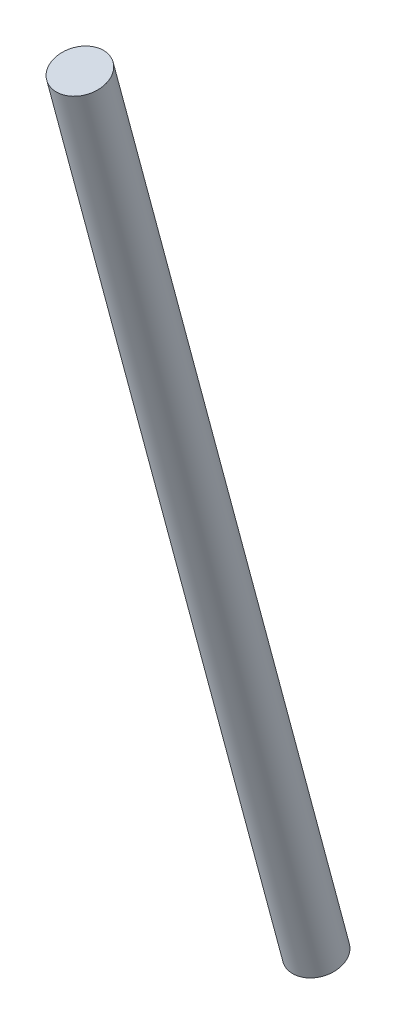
ISO-10303-21;
HEADER;
FILE_DESCRIPTION(('STEP AP214'),'2;1');
FILE_NAME('part.step','',(''),(''),'','','');
FILE_SCHEMA(('AUTOMOTIVE_DESIGN { 1 0 10303 214 1 1 1 1 }'));
ENDSEC;
DATA;
#1=APPLICATION_CONTEXT('core data for automotive mechanical design processes');
#2=APPLICATION_PROTOCOL_DEFINITION('international standard','automotive_design',2000,#1);
#3=PRODUCT_CONTEXT('',#1,'mechanical');
#4=PRODUCT('Part','Part','',(#3));
#5=PRODUCT_RELATED_PRODUCT_CATEGORY('part','',(#4));
#6=PRODUCT_DEFINITION_FORMATION('','',#4);
#7=PRODUCT_DEFINITION_CONTEXT('part definition',#1,'design');
#8=PRODUCT_DEFINITION('design','',#6,#7);
#9=PRODUCT_DEFINITION_SHAPE('','',#8);
#10=(LENGTH_UNIT() NAMED_UNIT(*) SI_UNIT(.MILLI.,.METRE.));
#11=(NAMED_UNIT(*) PLANE_ANGLE_UNIT() SI_UNIT($,.RADIAN.));
#12=(NAMED_UNIT(*) SI_UNIT($,.STERADIAN.) SOLID_ANGLE_UNIT());
#13=UNCERTAINTY_MEASURE_WITH_UNIT(LENGTH_MEASURE(1.E-05),#10,'distance_accuracy_value','');
#14=(GEOMETRIC_REPRESENTATION_CONTEXT(3) GLOBAL_UNCERTAINTY_ASSIGNED_CONTEXT((#13)) GLOBAL_UNIT_ASSIGNED_CONTEXT((#10,
#11,#12)) REPRESENTATION_CONTEXT('',''));
#15=CARTESIAN_POINT('',(0.,0.,0.));
#16=DIRECTION('',(0.,0.,1.));
#17=DIRECTION('',(1.,0.,0.));
#18=AXIS2_PLACEMENT_3D('',#15,#16,#17);
#19=CARTESIAN_POINT('',(-5.715,48.4899319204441,5.50100058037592));
#20=DIRECTION('',(0.,0.965925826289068,0.258819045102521));
#21=DIRECTION('',(0.,-0.258819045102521,0.965925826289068));
#22=AXIS2_PLACEMENT_3D('',#19,#20,#21);
#23=PLANE('',#22);
#24=CARTESIAN_POINT('',(-5.715,48.4899319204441,5.50100058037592));
#25=DIRECTION('',(0.,-0.965925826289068,-0.258819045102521));
#26=DIRECTION('',(0.,0.258819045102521,-0.965925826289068));
#27=AXIS2_PLACEMENT_3D('',#24,#25,#26);
#28=CIRCLE('',#27,0.4064);
#29=CARTESIAN_POINT('',(-5.715,48.5951159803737,5.10844832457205));
#30=VERTEX_POINT('',#29);
#31=EDGE_CURVE('E19',#30,#30,#28,.T.);
#32=ORIENTED_EDGE('',*,*,#31,.F.);
#33=EDGE_LOOP('',(#32));
#34=FACE_BOUND('',#33,.T.);
#35=ADVANCED_FACE('F15',(#34),#23,.T.);
#36=CARTESIAN_POINT('',(-5.715,33.7692223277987,1.55659833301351));
#37=DIRECTION('',(0.,0.965925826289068,0.258819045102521));
#38=DIRECTION('',(0.,-0.258819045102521,0.965925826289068));
#39=AXIS2_PLACEMENT_3D('',#36,#37,#38);
#40=PLANE('',#39);
#41=CARTESIAN_POINT('',(-5.715,33.7692223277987,1.55659833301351));
#42=DIRECTION('',(0.,-0.965925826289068,-0.258819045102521));
#43=DIRECTION('',(0.,0.258819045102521,-0.965925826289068));
#44=AXIS2_PLACEMENT_3D('',#41,#42,#43);
#45=CIRCLE('',#44,0.4064);
#46=CARTESIAN_POINT('',(-5.715,33.8744063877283,1.16404607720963));
#47=VERTEX_POINT('',#46);
#48=EDGE_CURVE('E10',#47,#47,#45,.F.);
#49=ORIENTED_EDGE('',*,*,#48,.F.);
#50=EDGE_LOOP('',(#49));
#51=FACE_BOUND('',#50,.T.);
#52=ADVANCED_FACE('F30',(#51),#40,.F.);
#53=CARTESIAN_POINT('',(-5.715,48.4899319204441,5.50100058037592));
#54=DIRECTION('',(0.,-0.965925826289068,-0.258819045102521));
#55=DIRECTION('',(0.,0.258819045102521,-0.965925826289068));
#56=AXIS2_PLACEMENT_3D('',#53,#54,#55);
#57=CYLINDRICAL_SURFACE('',#56,0.4064);
#58=ORIENTED_EDGE('',*,*,#31,.T.);
#59=EDGE_LOOP('',(#58));
#60=FACE_BOUND('',#59,.T.);
#61=ORIENTED_EDGE('',*,*,#48,.T.);
#62=EDGE_LOOP('',(#61));
#63=FACE_BOUND('',#62,.T.);
#64=ADVANCED_FACE('F17',(#60,#63),#57,.T.);
#65=CLOSED_SHELL('',(#35,#52,#64));
#66=MANIFOLD_SOLID_BREP('B1',#65);
#67=ADVANCED_BREP_SHAPE_REPRESENTATION('',(#18,#66),#14);
#68=SHAPE_DEFINITION_REPRESENTATION(#9,#67);
ENDSEC;
END-ISO-10303-21;
